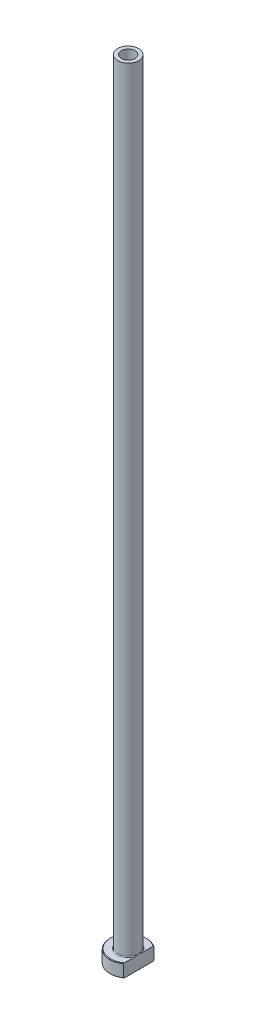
ISO-10303-21;
HEADER;
FILE_DESCRIPTION(('STEP AP214'),'2;1');
FILE_NAME('part.step','',(''),(''),'','','');
FILE_SCHEMA(('AUTOMOTIVE_DESIGN { 1 0 10303 214 1 1 1 1 }'));
ENDSEC;
DATA;
#1=APPLICATION_CONTEXT('core data for automotive mechanical design processes');
#2=APPLICATION_PROTOCOL_DEFINITION('international standard','automotive_design',2000,#1);
#3=PRODUCT_CONTEXT('',#1,'mechanical');
#4=PRODUCT('Part','Part','',(#3));
#5=PRODUCT_RELATED_PRODUCT_CATEGORY('part','',(#4));
#6=PRODUCT_DEFINITION_FORMATION('','',#4);
#7=PRODUCT_DEFINITION_CONTEXT('part definition',#1,'design');
#8=PRODUCT_DEFINITION('design','',#6,#7);
#9=PRODUCT_DEFINITION_SHAPE('','',#8);
#10=(LENGTH_UNIT() NAMED_UNIT(*) SI_UNIT(.MILLI.,.METRE.));
#11=(NAMED_UNIT(*) PLANE_ANGLE_UNIT() SI_UNIT($,.RADIAN.));
#12=(NAMED_UNIT(*) SI_UNIT($,.STERADIAN.) SOLID_ANGLE_UNIT());
#13=UNCERTAINTY_MEASURE_WITH_UNIT(LENGTH_MEASURE(1.E-05),#10,'distance_accuracy_value','');
#14=(GEOMETRIC_REPRESENTATION_CONTEXT(3) GLOBAL_UNCERTAINTY_ASSIGNED_CONTEXT((#13)) GLOBAL_UNIT_ASSIGNED_CONTEXT((#10,
#11,#12)) REPRESENTATION_CONTEXT('',''));
#15=CARTESIAN_POINT('',(0.,0.,0.));
#16=DIRECTION('',(0.,0.,1.));
#17=DIRECTION('',(1.,0.,0.));
#18=AXIS2_PLACEMENT_3D('',#15,#16,#17);
#19=CARTESIAN_POINT('',(0.,92.1876809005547,0.));
#20=DIRECTION('',(0.,1.,0.));
#21=DIRECTION('',(0.,0.,1.));
#22=AXIS2_PLACEMENT_3D('',#19,#20,#21);
#23=CYLINDRICAL_SURFACE('',#22,2.60000000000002);
#24=CARTESIAN_POINT('',(0.,300.,0.));
#25=DIRECTION('',(0.,1.,0.));
#26=DIRECTION('',(0.,0.,1.));
#27=AXIS2_PLACEMENT_3D('',#24,#25,#26);
#28=CIRCLE('',#27,2.60000000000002);
#29=CARTESIAN_POINT('',(0.,300.,2.60000000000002));
#30=VERTEX_POINT('',#29);
#31=EDGE_CURVE('E167',#30,#30,#28,.T.);
#32=ORIENTED_EDGE('',*,*,#31,.T.);
#33=EDGE_LOOP('',(#32));
#34=FACE_BOUND('',#33,.T.);
#35=CARTESIAN_POINT('',(0.,255.,0.));
#36=DIRECTION('',(0.,1.,0.));
#37=DIRECTION('',(0.,0.,1.));
#38=AXIS2_PLACEMENT_3D('',#35,#36,#37);
#39=CIRCLE('',#38,2.60000000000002);
#40=CARTESIAN_POINT('',(0.,255.,2.60000000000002));
#41=VERTEX_POINT('',#40);
#42=EDGE_CURVE('E170',#41,#41,#39,.T.);
#43=ORIENTED_EDGE('',*,*,#42,.F.);
#44=EDGE_LOOP('',(#43));
#45=FACE_BOUND('',#44,.T.);
#46=ADVANCED_FACE('F32',(#34,#45),#23,.F.);
#47=CARTESIAN_POINT('',(-2.60000000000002,300.,0.));
#48=DIRECTION('',(0.,1.,0.));
#49=DIRECTION('',(0.,0.,1.));
#50=AXIS2_PLACEMENT_3D('',#47,#48,#49);
#51=PLANE('',#50);
#52=CARTESIAN_POINT('',(0.,300.,0.));
#53=DIRECTION('',(0.,1.,0.));
#54=DIRECTION('',(0.,0.,1.));
#55=AXIS2_PLACEMENT_3D('',#52,#53,#54);
#56=CIRCLE('',#55,4.00000000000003);
#57=CARTESIAN_POINT('',(0.,300.,4.00000000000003));
#58=VERTEX_POINT('',#57);
#59=EDGE_CURVE('E174',#58,#58,#56,.T.);
#60=ORIENTED_EDGE('',*,*,#59,.T.);
#61=EDGE_LOOP('',(#60));
#62=FACE_BOUND('',#61,.T.);
#63=ORIENTED_EDGE('',*,*,#31,.F.);
#64=EDGE_LOOP('',(#63));
#65=FACE_BOUND('',#64,.T.);
#66=ADVANCED_FACE('F157',(#62,#65),#51,.T.);
#67=CARTESIAN_POINT('',(0.,92.1876809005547,0.));
#68=DIRECTION('',(0.,1.,0.));
#69=DIRECTION('',(0.,0.,1.));
#70=AXIS2_PLACEMENT_3D('',#67,#68,#69);
#71=CYLINDRICAL_SURFACE('',#70,4.00000000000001);
#72=CARTESIAN_POINT('',(0.,5.3,0.));
#73=DIRECTION('',(0.,1.,0.));
#74=DIRECTION('',(0.,0.,1.));
#75=AXIS2_PLACEMENT_3D('',#72,#73,#74);
#76=CIRCLE('',#75,4.00000000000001);
#77=CARTESIAN_POINT('',(4.,5.3,0.));
#78=VERTEX_POINT('',#77);
#79=EDGE_CURVE('E180',#78,#78,#76,.T.);
#80=ORIENTED_EDGE('',*,*,#79,.T.);
#81=EDGE_LOOP('',(#80));
#82=FACE_BOUND('',#81,.T.);
#83=ORIENTED_EDGE('',*,*,#59,.F.);
#84=EDGE_LOOP('',(#83));
#85=FACE_BOUND('',#84,.T.);
#86=ADVANCED_FACE('F162',(#82,#85),#71,.T.);
#87=CARTESIAN_POINT('',(-3.99999999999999,5.,0.));
#88=DIRECTION('',(0.,1.,0.));
#89=DIRECTION('',(0.,0.,1.));
#90=AXIS2_PLACEMENT_3D('',#87,#88,#89);
#91=PLANE('',#90);
#92=DIRECTION('',(0.,0.,1.));
#93=VECTOR('',#92,1.);
#94=CARTESIAN_POINT('',(4.,5.,0.));
#95=LINE('',#94,#93);
#96=CARTESIAN_POINT('',(4.,5.,-5.49909083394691));
#97=VERTEX_POINT('',#96);
#98=CARTESIAN_POINT('',(4.,5.,-1.57797338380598));
#99=VERTEX_POINT('',#98);
#100=EDGE_CURVE('E54',#97,#99,#95,.T.);
#101=ORIENTED_EDGE('',*,*,#100,.F.);
#102=CARTESIAN_POINT('',(0.,5.,0.));
#103=DIRECTION('',(0.,1.,0.));
#104=DIRECTION('',(0.,0.,1.));
#105=AXIS2_PLACEMENT_3D('',#102,#103,#104);
#106=CIRCLE('',#105,6.79999999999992);
#107=CARTESIAN_POINT('',(3.99999999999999,5.,5.49909083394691));
#108=VERTEX_POINT('',#107);
#109=EDGE_CURVE('E186',#97,#108,#106,.T.);
#110=ORIENTED_EDGE('',*,*,#109,.T.);
#111=CARTESIAN_POINT('',(4.,5.,1.57797338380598));
#112=VERTEX_POINT('',#111);
#113=EDGE_CURVE('E134',#112,#108,#95,.T.);
#114=ORIENTED_EDGE('',*,*,#113,.F.);
#115=CARTESIAN_POINT('',(0.,5.,0.));
#116=DIRECTION('',(0.,1.,0.));
#117=DIRECTION('',(0.,0.,1.));
#118=AXIS2_PLACEMENT_3D('',#115,#116,#117);
#119=CIRCLE('',#118,4.30000000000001);
#120=EDGE_CURVE('E183',#112,#99,#119,.F.);
#121=ORIENTED_EDGE('',*,*,#120,.T.);
#122=EDGE_LOOP('',(#101,#110,#114,#121));
#123=FACE_BOUND('',#122,.T.);
#124=ADVANCED_FACE('F197',(#123),#91,.T.);
#125=CARTESIAN_POINT('',(0.,92.1876809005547,0.));
#126=DIRECTION('',(0.,1.,0.));
#127=DIRECTION('',(0.,0.,1.));
#128=AXIS2_PLACEMENT_3D('',#125,#126,#127);
#129=CYLINDRICAL_SURFACE('',#128,6.99999999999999);
#130=DIRECTION('',(0.,-1.,0.));
#131=VECTOR('',#130,1.);
#132=CARTESIAN_POINT('',(3.99999999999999,300.,5.74456264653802));
#133=LINE('',#132,#131);
#134=CARTESIAN_POINT('',(3.99999999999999,4.79999999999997,5.74456264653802));
#135=VERTEX_POINT('',#134);
#136=CARTESIAN_POINT('',(3.99999999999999,0.20000000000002,5.74456264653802));
#137=VERTEX_POINT('',#136);
#138=EDGE_CURVE('E82',#135,#137,#133,.T.);
#139=ORIENTED_EDGE('',*,*,#138,.F.);
#140=CARTESIAN_POINT('',(0.,4.79999999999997,0.));
#141=DIRECTION('',(0.,1.,0.));
#142=DIRECTION('',(0.,0.,1.));
#143=AXIS2_PLACEMENT_3D('',#140,#141,#142);
#144=CIRCLE('',#143,6.99999999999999);
#145=CARTESIAN_POINT('',(4.,4.79999999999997,-5.74456264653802));
#146=VERTEX_POINT('',#145);
#147=EDGE_CURVE('E95',#135,#146,#144,.F.);
#148=ORIENTED_EDGE('',*,*,#147,.T.);
#149=DIRECTION('',(0.,-1.,0.));
#150=VECTOR('',#149,1.);
#151=CARTESIAN_POINT('',(4.,300.,-5.74456264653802));
#152=LINE('',#151,#150);
#153=CARTESIAN_POINT('',(4.,0.20000000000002,-5.74456264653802));
#154=VERTEX_POINT('',#153);
#155=EDGE_CURVE('E192',#146,#154,#152,.T.);
#156=ORIENTED_EDGE('',*,*,#155,.T.);
#157=CARTESIAN_POINT('',(0.,0.20000000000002,0.));
#158=DIRECTION('',(0.,-1.,0.));
#159=DIRECTION('',(0.,0.,-1.));
#160=AXIS2_PLACEMENT_3D('',#157,#158,#159);
#161=CIRCLE('',#160,6.99999999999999);
#162=EDGE_CURVE('E98',#154,#137,#161,.F.);
#163=ORIENTED_EDGE('',*,*,#162,.T.);
#164=EDGE_LOOP('',(#139,#148,#156,#163));
#165=FACE_BOUND('',#164,.T.);
#166=ADVANCED_FACE('F190',(#165),#129,.T.);
#167=CARTESIAN_POINT('',(-6.99999999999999,0.,0.));
#168=DIRECTION('',(0.,-1.,0.));
#169=DIRECTION('',(0.,0.,-1.));
#170=AXIS2_PLACEMENT_3D('',#167,#168,#169);
#171=PLANE('',#170);
#172=CARTESIAN_POINT('',(0.,0.,0.));
#173=DIRECTION('',(0.,-1.,0.));
#174=DIRECTION('',(0.,0.,-1.));
#175=AXIS2_PLACEMENT_3D('',#172,#173,#174);
#176=CIRCLE('',#175,3.34999999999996);
#177=CARTESIAN_POINT('',(0.,0.,-3.34999999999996));
#178=VERTEX_POINT('',#177);
#179=EDGE_CURVE('E40',#178,#178,#176,.F.);
#180=ORIENTED_EDGE('',*,*,#179,.T.);
#181=EDGE_LOOP('',(#180));
#182=FACE_BOUND('',#181,.T.);
#183=DIRECTION('',(0.,0.,-1.));
#184=VECTOR('',#183,1.);
#185=CARTESIAN_POINT('',(3.99999999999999,0.,5.74456264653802));
#186=LINE('',#185,#184);
#187=CARTESIAN_POINT('',(3.99999999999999,0.,5.49909083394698));
#188=VERTEX_POINT('',#187);
#189=CARTESIAN_POINT('',(4.,0.,-5.49909083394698));
#190=VERTEX_POINT('',#189);
#191=EDGE_CURVE('E47',#188,#190,#186,.T.);
#192=ORIENTED_EDGE('',*,*,#191,.F.);
#193=CARTESIAN_POINT('',(0.,0.,0.));
#194=DIRECTION('',(0.,-1.,0.));
#195=DIRECTION('',(0.,0.,-1.));
#196=AXIS2_PLACEMENT_3D('',#193,#194,#195);
#197=CIRCLE('',#196,6.79999999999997);
#198=EDGE_CURVE('E92',#188,#190,#197,.T.);
#199=ORIENTED_EDGE('',*,*,#198,.T.);
#200=EDGE_LOOP('',(#192,#199));
#201=FACE_BOUND('',#200,.T.);
#202=ADVANCED_FACE('F91',(#182,#201),#171,.T.);
#203=CARTESIAN_POINT('',(0.,92.1876809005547,0.));
#204=DIRECTION('',(0.,1.,0.));
#205=DIRECTION('',(0.,0.,1.));
#206=AXIS2_PLACEMENT_3D('',#203,#204,#205);
#207=CYLINDRICAL_SURFACE('',#206,2.85000000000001);
#208=CARTESIAN_POINT('',(0.,0.499999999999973,0.));
#209=DIRECTION('',(0.,-1.,0.));
#210=DIRECTION('',(0.,0.,-1.));
#211=AXIS2_PLACEMENT_3D('',#208,#209,#210);
#212=CIRCLE('',#211,2.85000000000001);
#213=CARTESIAN_POINT('',(0.,0.499999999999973,-2.85000000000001));
#214=VERTEX_POINT('',#213);
#215=EDGE_CURVE('E11',#214,#214,#212,.T.);
#216=ORIENTED_EDGE('',*,*,#215,.T.);
#217=EDGE_LOOP('',(#216));
#218=FACE_BOUND('',#217,.T.);
#219=CARTESIAN_POINT('',(0.,243.,0.));
#220=DIRECTION('',(0.,1.,0.));
#221=DIRECTION('',(0.,0.,1.));
#222=AXIS2_PLACEMENT_3D('',#219,#220,#221);
#223=CIRCLE('',#222,2.85000000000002);
#224=CARTESIAN_POINT('',(0.,243.,2.85000000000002));
#225=VERTEX_POINT('',#224);
#226=EDGE_CURVE('E172',#225,#225,#223,.T.);
#227=ORIENTED_EDGE('',*,*,#226,.T.);
#228=EDGE_LOOP('',(#227));
#229=FACE_BOUND('',#228,.T.);
#230=ADVANCED_FACE('F215',(#218,#229),#207,.F.);
#231=CARTESIAN_POINT('',(0.,243.,0.));
#232=DIRECTION('',(0.,-1.,0.));
#233=DIRECTION('',(0.,0.,-1.));
#234=AXIS2_PLACEMENT_3D('',#231,#232,#233);
#235=CONICAL_SURFACE('',#234,2.85000000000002,0.0208303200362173);
#236=ORIENTED_EDGE('',*,*,#42,.T.);
#237=EDGE_LOOP('',(#236));
#238=FACE_BOUND('',#237,.T.);
#239=ORIENTED_EDGE('',*,*,#226,.F.);
#240=EDGE_LOOP('',(#239));
#241=FACE_BOUND('',#240,.T.);
#242=ADVANCED_FACE('F111',(#238,#241),#235,.F.);
#243=CARTESIAN_POINT('',(0.,5.3,0.));
#244=DIRECTION('',(0.,1.,0.));
#245=DIRECTION('',(0.,0.,1.));
#246=AXIS2_PLACEMENT_3D('',#243,#244,#245);
#247=TOROIDAL_SURFACE('',#246,4.30000000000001,0.3);
#248=ORIENTED_EDGE('',*,*,#120,.F.);
#249=CARTESIAN_POINT('',(4.,5.3,0.));
#250=CARTESIAN_POINT('',(4.,5.30000062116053,-1.06261146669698E-10));
#251=CARTESIAN_POINT('',(4.,5.30000124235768,2.17726199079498E-07));
#252=CARTESIAN_POINT('',(4.,5.30000240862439,8.36141292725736E-07));
#253=CARTESIAN_POINT('',(4.,5.30000294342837,1.25011714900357E-06));
#254=CARTESIAN_POINT('',(4.,5.30000404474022,2.23959386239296E-06));
#255=CARTESIAN_POINT('',(4.,5.30000459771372,2.83084521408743E-06));
#256=CARTESIAN_POINT('',(4.,5.30000559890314,4.06516670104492E-06));
#257=CARTESIAN_POINT('',(4.,5.30000604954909,4.70640147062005E-06));
#258=CARTESIAN_POINT('',(4.,5.30000769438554,7.15677314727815E-06));
#259=CARTESIAN_POINT('',(4.,5.30000879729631,9.02996112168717E-06));
#260=CARTESIAN_POINT('',(4.,5.30001063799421,1.27664902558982E-05));
#261=CARTESIAN_POINT('',(4.,5.30001139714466,1.46197820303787E-05));
#262=CARTESIAN_POINT('',(4.,5.30001453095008,2.23679246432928E-05));
#263=CARTESIAN_POINT('',(4.,5.3000168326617,2.82968783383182E-05));
#264=CARTESIAN_POINT('',(4.,5.30002027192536,3.95668769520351E-05));
#265=CARTESIAN_POINT('',(4.,5.30002152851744,4.48715497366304E-05));
#266=CARTESIAN_POINT('',(4.,5.30003060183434,8.40118257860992E-05));
#267=CARTESIAN_POINT('',(4.,5.3000373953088,0.000118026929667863));
#268=CARTESIAN_POINT('',(4.,5.30006713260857,0.000252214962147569));
#269=CARTESIAN_POINT('',(4.,5.30009559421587,0.000351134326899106));
#270=CARTESIAN_POINT('',(4.,5.30020622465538,0.000742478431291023));
#271=CARTESIAN_POINT('',(4.,5.30028475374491,0.00103561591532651));
#272=CARTESIAN_POINT('',(4.,5.30059889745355,0.00219920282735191));
#273=CARTESIAN_POINT('',(4.,5.30083905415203,0.00306873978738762));
#274=CARTESIAN_POINT('',(4.,5.30183682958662,0.0066914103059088));
#275=CARTESIAN_POINT('',(4.,5.30258877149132,0.00944568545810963));
#276=CARTESIAN_POINT('',(3.99999999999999,5.31066890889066,0.0390293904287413));
#277=CARTESIAN_POINT('',(4.,5.31802631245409,0.0658531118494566));
#278=CARTESIAN_POINT('',(4.,5.33239676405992,0.118441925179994));
#279=CARTESIAN_POINT('',(4.,5.33941183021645,0.144206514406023));
#280=CARTESIAN_POINT('',(4.,5.35427366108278,0.199017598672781));
#281=CARTESIAN_POINT('',(4.,5.36211313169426,0.228066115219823));
#282=CARTESIAN_POINT('',(4.,5.37776349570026,0.28651184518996));
#283=CARTESIAN_POINT('',(4.,5.38557313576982,0.315909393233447));
#284=CARTESIAN_POINT('',(4.,5.404256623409,0.386994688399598));
#285=CARTESIAN_POINT('',(4.,5.41505237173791,0.428703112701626));
#286=CARTESIAN_POINT('',(4.,5.4359231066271,0.511098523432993));
#287=CARTESIAN_POINT('',(4.,5.44600969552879,0.551782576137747));
#288=CARTESIAN_POINT('',(4.,5.47850986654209,0.686599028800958));
#289=CARTESIAN_POINT('',(4.,5.49978370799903,0.781011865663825));
#290=CARTESIAN_POINT('',(4.,5.53807543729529,0.971847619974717));
#291=CARTESIAN_POINT('',(4.,5.55504273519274,1.06828120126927));
#292=CARTESIAN_POINT('',(4.,5.57582405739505,1.21752725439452));
#293=CARTESIAN_POINT('',(4.,5.58209796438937,1.26999379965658));
#294=CARTESIAN_POINT('',(4.,5.59210686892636,1.37516324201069));
#295=CARTESIAN_POINT('',(4.,5.59584265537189,1.42786606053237));
#296=CARTESIAN_POINT('',(4.,5.60010438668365,1.53310673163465));
#297=CARTESIAN_POINT('',(4.,5.6006487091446,1.58564378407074));
#298=CARTESIAN_POINT('',(4.,5.59767158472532,1.69058605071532));
#299=CARTESIAN_POINT('',(4.,5.59415502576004,1.74299134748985));
#300=CARTESIAN_POINT('',(4.,5.58503062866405,1.81903290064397));
#301=CARTESIAN_POINT('',(4.,5.58157617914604,1.84292934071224));
#302=CARTESIAN_POINT('',(4.,5.57329952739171,1.89051061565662));
#303=CARTESIAN_POINT('',(4.,5.56847619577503,1.91419525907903));
#304=CARTESIAN_POINT('',(4.,5.55726644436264,1.96092888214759));
#305=CARTESIAN_POINT('',(4.,5.55089740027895,1.9839819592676));
#306=CARTESIAN_POINT('',(4.,5.53623434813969,2.02945550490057));
#307=CARTESIAN_POINT('',(4.,5.52794253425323,2.0518766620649));
#308=CARTESIAN_POINT('',(4.,5.50887098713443,2.09590631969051));
#309=CARTESIAN_POINT('',(4.,5.49806837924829,2.11750508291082));
#310=CARTESIAN_POINT('',(4.,5.47333401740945,2.15885583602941));
#311=CARTESIAN_POINT('',(4.,5.45941272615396,2.1786136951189));
#312=CARTESIAN_POINT('',(4.,5.4358822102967,2.20522942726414));
#313=CARTESIAN_POINT('',(4.,5.42781139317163,2.2134404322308));
#314=CARTESIAN_POINT('',(4.,5.41065114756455,2.228751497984));
#315=CARTESIAN_POINT('',(4.,5.40156129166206,2.23585108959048));
#316=CARTESIAN_POINT('',(4.,5.38220524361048,2.24859694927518));
#317=CARTESIAN_POINT('',(4.,5.37192420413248,2.25422119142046));
#318=CARTESIAN_POINT('',(4.,5.35045072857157,2.26331064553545));
#319=CARTESIAN_POINT('',(4.,5.33926122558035,2.26678251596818));
#320=CARTESIAN_POINT('',(4.,5.31952044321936,2.27051268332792));
#321=CARTESIAN_POINT('',(4.,5.31108453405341,2.27139016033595));
#322=CARTESIAN_POINT('',(4.,5.29418624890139,2.27168963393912));
#323=CARTESIAN_POINT('',(4.,5.28572387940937,2.27111196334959));
#324=CARTESIAN_POINT('',(4.,5.26904138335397,2.26855580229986));
#325=CARTESIAN_POINT('',(4.,5.26082066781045,2.26658107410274));
#326=CARTESIAN_POINT('',(4.,5.24478214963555,2.26139496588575));
#327=CARTESIAN_POINT('',(4.,5.23696461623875,2.25818277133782));
#328=CARTESIAN_POINT('',(4.,5.21851235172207,2.24908332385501));
#329=CARTESIAN_POINT('',(4.,5.2081521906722,2.24264095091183));
#330=CARTESIAN_POINT('',(4.,5.18857975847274,2.22819957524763));
#331=CARTESIAN_POINT('',(4.,5.17937061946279,2.22019647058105));
#332=CARTESIAN_POINT('',(4.,5.15665383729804,2.19777756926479));
#333=CARTESIAN_POINT('',(4.,5.14403484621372,2.18246908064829));
#334=CARTESIAN_POINT('',(4.,5.12118369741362,2.15020843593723));
#335=CARTESIAN_POINT('',(4.,5.11095480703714,2.13325407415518));
#336=CARTESIAN_POINT('',(4.,5.09273574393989,2.09892324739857));
#337=CARTESIAN_POINT('',(4.,5.08468212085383,2.08157988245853));
#338=CARTESIAN_POINT('',(4.,5.07005901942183,2.04627072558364));
#339=CARTESIAN_POINT('',(4.,5.06349101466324,2.02830433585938));
#340=CARTESIAN_POINT('',(4.,5.0455548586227,1.97350761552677));
#341=CARTESIAN_POINT('',(4.,5.03608974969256,1.93605770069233));
#342=CARTESIAN_POINT('',(4.,5.01780569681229,1.84529235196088));
#343=CARTESIAN_POINT('',(4.,5.01077018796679,1.79164082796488));
#344=CARTESIAN_POINT('',(4.,5.00182846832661,1.68379947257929));
#345=CARTESIAN_POINT('',(4.,4.99993887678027,1.62960846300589));
#346=CARTESIAN_POINT('',(4.,5.00006129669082,1.5236120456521));
#347=CARTESIAN_POINT('',(4.,5.00190698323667,1.47180551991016));
#348=CARTESIAN_POINT('',(4.,5.00841243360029,1.36835357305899));
#349=CARTESIAN_POINT('',(4.,5.01307376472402,1.316708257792));
#350=CARTESIAN_POINT('',(4.,5.0290548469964,1.17431887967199));
#351=CARTESIAN_POINT('',(4.,5.04274090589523,1.08384207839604));
#352=CARTESIAN_POINT('',(4.,5.0670171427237,0.947757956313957));
#353=CARTESIAN_POINT('',(4.,5.07585573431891,0.90181406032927));
#354=CARTESIAN_POINT('',(4.,5.09458665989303,0.810008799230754));
#355=CARTESIAN_POINT('',(4.,5.10448180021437,0.764148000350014));
#356=CARTESIAN_POINT('',(4.,5.1289243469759,0.655631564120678));
#357=CARTESIAN_POINT('',(4.,5.14383556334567,0.593058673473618));
#358=CARTESIAN_POINT('',(4.,5.17458762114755,0.468885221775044));
#359=CARTESIAN_POINT('',(4.,5.19041623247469,0.407281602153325));
#360=CARTESIAN_POINT('',(4.,5.22090834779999,0.291232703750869));
#361=CARTESIAN_POINT('',(4.,5.23550024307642,0.236768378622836));
#362=CARTESIAN_POINT('',(3.99999999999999,5.26562550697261,0.125604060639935));
#363=CARTESIAN_POINT('',(3.99999999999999,5.28117250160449,0.068907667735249));
#364=CARTESIAN_POINT('',(4.,5.29741226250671,0.00944154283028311));
#365=CARTESIAN_POINT('',(4.,5.29816540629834,0.00668315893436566));
#366=CARTESIAN_POINT('',(4.,5.29916346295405,0.00305954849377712));
#367=CARTESIAN_POINT('',(4.,5.29940273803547,0.00219318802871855));
#368=CARTESIAN_POINT('',(4.,5.29971580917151,0.00103357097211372));
#369=CARTESIAN_POINT('',(4.,5.29979412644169,0.000741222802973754));
#370=CARTESIAN_POINT('',(4.,5.29990450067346,0.000350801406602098));
#371=CARTESIAN_POINT('',(4.,5.29993292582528,0.000252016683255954));
#372=CARTESIAN_POINT('',(4.,5.29996263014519,0.000117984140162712));
#373=CARTESIAN_POINT('',(4.,5.299969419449,8.39881949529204E-05));
#374=CARTESIAN_POINT('',(4.,5.29997848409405,4.48674047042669E-05));
#375=CARTESIAN_POINT('',(4.,5.29997973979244,3.95638224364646E-05));
#376=CARTESIAN_POINT('',(4.,5.29998317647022,2.82960367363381E-05));
#377=CARTESIAN_POINT('',(4.,5.29998547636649,2.23681476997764E-05));
#378=CARTESIAN_POINT('',(4.,5.29998860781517,1.46211013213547E-05));
#379=CARTESIAN_POINT('',(4.,5.29998936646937,1.27678912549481E-05));
#380=CARTESIAN_POINT('',(4.,5.29999120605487,9.03144163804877E-06));
#381=CARTESIAN_POINT('',(4.,5.29999230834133,7.15824173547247E-06));
#382=CARTESIAN_POINT('',(4.,5.29999395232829,4.70775574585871E-06));
#383=CARTESIAN_POINT('',(4.,5.29999440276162,4.06646440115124E-06));
#384=CARTESIAN_POINT('',(4.,5.2999954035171,2.83199139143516E-06));
#385=CARTESIAN_POINT('',(4.,5.299995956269,2.24064386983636E-06));
#386=CARTESIAN_POINT('',(4.,5.29999705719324,1.25094003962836E-06));
#387=CARTESIAN_POINT('',(4.,5.29999759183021,8.36841346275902E-07));
#388=CARTESIAN_POINT('',(4.,5.29999875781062,2.18117879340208E-07));
#389=CARTESIAN_POINT('',(4.,5.299999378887,1.0625422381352E-10));
#390=CARTESIAN_POINT('',(4.,5.3,0.));
#391=B_SPLINE_CURVE_WITH_KNOTS('',3,(#249,#250,#251,#252,#253,#254,#255,#256,#257,#258,#259,
#260,#261,#262,#263,#264,#265,#266,#267,#268,#269,#270,#271,#272,#273,#274,#275,#276,#277,#278,
#279,#280,#281,#282,#283,#284,#285,#286,#287,#288,#289,#290,#291,#292,#293,#294,#295,#296,#297,
#298,#299,#300,#301,#302,#303,#304,#305,#306,#307,#308,#309,#310,#311,#312,#313,#314,#315,#316,
#317,#318,#319,#320,#321,#322,#323,#324,#325,#326,#327,#328,#329,#330,#331,#332,#333,#334,#335,
#336,#337,#338,#339,#340,#341,#342,#343,#344,#345,#346,#347,#348,#349,#350,#351,#352,#353,#354,
#355,#356,#357,#358,#359,#360,#361,#362,#363,#364,#365,#366,#367,#368,#369,#370,#371,#372,#373,
#374,#375,#376,#377,#378,#379,#380,#381,#382,#383,#384,#385,#386,#387,#388,#389,#390),
.UNSPECIFIED.,.T.,.F.,(4,2,2,2,2,2,2,2,2,2,2,2,2,2,2,2,2,2,2,2,2,2,2,2,2,2,2,2,2,2,2,2,2,2,2,2,
2,2,2,2,2,2,2,2,2,2,2,2,2,2,2,2,2,2,2,2,2,2,2,2,2,2,2,2,2,2,2,2,2,2,4),(0.,1.87484270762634E-06,
3.90179765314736E-06,6.31683512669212E-06,8.66651565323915E-06,1.51627509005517E-05,
2.11657875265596E-05,4.02090722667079E-05,5.65429401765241E-05,0.0001606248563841,
0.000469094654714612,0.00137985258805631,0.00408571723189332,0.0126514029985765,
0.0960918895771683,0.176200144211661,0.266463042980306,0.357714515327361,0.48696124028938,
0.612707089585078,0.902988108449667,1.19653589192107,1.35501075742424,1.51343634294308,
1.67094875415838,1.82827177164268,1.90067591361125,1.97313996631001,2.04482437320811,
2.11642737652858,2.18871023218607,2.26075412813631,2.29521947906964,2.32969934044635,
2.36466792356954,2.39952778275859,2.42485422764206,2.45017488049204,2.47542760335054,
2.50069697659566,2.53708899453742,2.57357798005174,2.63276032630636,2.69202310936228,
2.74930315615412,2.80663977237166,2.92223125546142,3.08420752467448,3.24670629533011,
3.40212850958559,3.55763731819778,3.83192962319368,3.97228382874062,4.11302057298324,
4.30598130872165,4.49678885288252,4.6659444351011,4.84230602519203,4.85088453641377,
4.85358051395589,4.85448881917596,4.8547968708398,4.8549008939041,4.8549172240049,
4.85493626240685,4.85494226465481,4.85494875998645,4.85495110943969,4.85495352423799,
4.85495555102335,4.8549574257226),.UNSPECIFIED.);
#392=EDGE_CURVE('E126',#112,#78,#391,.T.);
#393=ORIENTED_EDGE('',*,*,#392,.T.);
#394=ORIENTED_EDGE('',*,*,#79,.F.);
#395=CARTESIAN_POINT('',(4.,5.3,0.));
#396=CARTESIAN_POINT('',(4.,5.29999937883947,1.0626241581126E-10));
#397=CARTESIAN_POINT('',(4.,5.29999875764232,-2.17726197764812E-07));
#398=CARTESIAN_POINT('',(4.,5.2999975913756,-8.36141291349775E-07));
#399=CARTESIAN_POINT('',(4.,5.29999705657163,-1.2501171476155E-06));
#400=CARTESIAN_POINT('',(4.,5.29999595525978,-2.23959386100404E-06));
#401=CARTESIAN_POINT('',(4.,5.29999540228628,-2.83084521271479E-06));
#402=CARTESIAN_POINT('',(4.,5.29999440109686,-4.06516669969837E-06));
#403=CARTESIAN_POINT('',(4.,5.29999395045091,-4.7064014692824E-06));
#404=CARTESIAN_POINT('',(4.,5.29999230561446,-7.15677314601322E-06));
#405=CARTESIAN_POINT('',(4.,5.29999120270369,-9.02996112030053E-06));
#406=CARTESIAN_POINT('',(4.,5.29998936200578,-1.27664902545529E-05));
#407=CARTESIAN_POINT('',(4.,5.29998860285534,-1.46197820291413E-05));
#408=CARTESIAN_POINT('',(4.,5.29998546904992,-2.23679246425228E-05));
#409=CARTESIAN_POINT('',(4.,5.2999831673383,-2.8296878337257E-05));
#410=CARTESIAN_POINT('',(4.,5.29997972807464,-3.95668769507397E-05));
#411=CARTESIAN_POINT('',(4.,5.29997847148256,-4.48715497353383E-05));
#412=CARTESIAN_POINT('',(4.,5.29996939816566,-8.40118257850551E-05));
#413=CARTESIAN_POINT('',(4.,5.2999626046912,-0.000118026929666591));
#414=CARTESIAN_POINT('',(4.,5.29993286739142,-0.000252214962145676));
#415=CARTESIAN_POINT('',(4.,5.29990440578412,-0.000351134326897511));
#416=CARTESIAN_POINT('',(4.,5.29979377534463,-0.000742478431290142));
#417=CARTESIAN_POINT('',(4.,5.29971524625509,-0.00103561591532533));
#418=CARTESIAN_POINT('',(4.,5.29940110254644,-0.00219920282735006));
#419=CARTESIAN_POINT('',(4.,5.29916094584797,-0.00306873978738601));
#420=CARTESIAN_POINT('',(4.,5.29816317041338,-0.00669141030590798));
#421=CARTESIAN_POINT('',(4.,5.29741122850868,-0.00944568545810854));
#422=CARTESIAN_POINT('',(3.99999999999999,5.28933109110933,-0.0390293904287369));
#423=CARTESIAN_POINT('',(4.,5.2819736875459,-0.065853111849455));
#424=CARTESIAN_POINT('',(4.,5.26760323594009,-0.118441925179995));
#425=CARTESIAN_POINT('',(4.,5.26058816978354,-0.144206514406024));
#426=CARTESIAN_POINT('',(4.,5.24572633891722,-0.199017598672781));
#427=CARTESIAN_POINT('',(4.,5.23788686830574,-0.228066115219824));
#428=CARTESIAN_POINT('',(4.,5.22223650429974,-0.28651184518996));
#429=CARTESIAN_POINT('',(4.,5.21442686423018,-0.315909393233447));
#430=CARTESIAN_POINT('',(4.,5.195743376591,-0.386994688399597));
#431=CARTESIAN_POINT('',(4.,5.18494762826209,-0.428703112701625));
#432=CARTESIAN_POINT('',(4.,5.1640768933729,-0.511098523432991));
#433=CARTESIAN_POINT('',(4.,5.1539903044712,-0.551782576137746));
#434=CARTESIAN_POINT('',(4.,5.12149013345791,-0.686599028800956));
#435=CARTESIAN_POINT('',(4.,5.10021629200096,-0.781011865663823));
#436=CARTESIAN_POINT('',(4.,5.06192456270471,-0.971847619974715));
#437=CARTESIAN_POINT('',(4.,5.04495726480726,-1.06828120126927));
#438=CARTESIAN_POINT('',(4.,5.02417594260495,-1.21752725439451));
#439=CARTESIAN_POINT('',(4.,5.01790203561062,-1.26999379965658));
#440=CARTESIAN_POINT('',(4.,5.00789313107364,-1.37516324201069));
#441=CARTESIAN_POINT('',(4.,5.00415734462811,-1.42786606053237));
#442=CARTESIAN_POINT('',(4.,4.99989561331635,-1.53310673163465));
#443=CARTESIAN_POINT('',(4.,4.9993512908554,-1.58564378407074));
#444=CARTESIAN_POINT('',(4.,5.00232841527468,-1.69058605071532));
#445=CARTESIAN_POINT('',(4.,5.00584497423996,-1.74299134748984));
#446=CARTESIAN_POINT('',(4.,5.01496937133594,-1.81903290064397));
#447=CARTESIAN_POINT('',(4.,5.01842382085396,-1.84292934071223));
#448=CARTESIAN_POINT('',(4.,5.02670047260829,-1.89051061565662));
#449=CARTESIAN_POINT('',(4.,5.03152380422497,-1.91419525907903));
#450=CARTESIAN_POINT('',(4.,5.04273355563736,-1.96092888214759));
#451=CARTESIAN_POINT('',(4.,5.04910259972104,-1.9839819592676));
#452=CARTESIAN_POINT('',(4.,5.06376565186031,-2.02945550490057));
#453=CARTESIAN_POINT('',(4.,5.07205746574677,-2.0518766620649));
#454=CARTESIAN_POINT('',(4.,5.09112901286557,-2.0959063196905));
#455=CARTESIAN_POINT('',(4.,5.10193162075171,-2.11750508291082));
#456=CARTESIAN_POINT('',(4.,5.12666598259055,-2.15885583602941));
#457=CARTESIAN_POINT('',(4.,5.14058727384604,-2.17861369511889));
#458=CARTESIAN_POINT('',(4.,5.1641177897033,-2.20522942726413));
#459=CARTESIAN_POINT('',(4.,5.17218860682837,-2.2134404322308));
#460=CARTESIAN_POINT('',(4.,5.18934885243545,-2.22875149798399));
#461=CARTESIAN_POINT('',(4.,5.19843870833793,-2.23585108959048));
#462=CARTESIAN_POINT('',(4.,5.21779475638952,-2.24859694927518));
#463=CARTESIAN_POINT('',(4.,5.22807579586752,-2.25422119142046));
#464=CARTESIAN_POINT('',(4.,5.24954927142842,-2.26331064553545));
#465=CARTESIAN_POINT('',(4.,5.26073877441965,-2.26678251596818));
#466=CARTESIAN_POINT('',(4.,5.28047955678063,-2.27051268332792));
#467=CARTESIAN_POINT('',(4.,5.28891546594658,-2.27139016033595));
#468=CARTESIAN_POINT('',(4.,5.3058137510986,-2.27168963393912));
#469=CARTESIAN_POINT('',(4.,5.31427612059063,-2.27111196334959));
#470=CARTESIAN_POINT('',(4.,5.33095861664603,-2.26855580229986));
#471=CARTESIAN_POINT('',(4.,5.33917933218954,-2.26658107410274));
#472=CARTESIAN_POINT('',(4.,5.35521785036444,-2.26139496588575));
#473=CARTESIAN_POINT('',(4.,5.36303538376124,-2.25818277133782));
#474=CARTESIAN_POINT('',(4.,5.38148764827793,-2.24908332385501));
#475=CARTESIAN_POINT('',(4.,5.3918478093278,-2.24264095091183));
#476=CARTESIAN_POINT('',(4.,5.41142024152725,-2.22819957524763));
#477=CARTESIAN_POINT('',(4.,5.4206293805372,-2.22019647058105));
#478=CARTESIAN_POINT('',(4.,5.44334616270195,-2.19777756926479));
#479=CARTESIAN_POINT('',(4.,5.45596515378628,-2.18246908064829));
#480=CARTESIAN_POINT('',(4.,5.47881630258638,-2.15020843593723));
#481=CARTESIAN_POINT('',(4.,5.48904519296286,-2.13325407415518));
#482=CARTESIAN_POINT('',(4.,5.50726425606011,-2.09892324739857));
#483=CARTESIAN_POINT('',(4.,5.51531787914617,-2.08157988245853));
#484=CARTESIAN_POINT('',(4.,5.52994098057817,-2.04627072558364));
#485=CARTESIAN_POINT('',(4.,5.53650898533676,-2.02830433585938));
#486=CARTESIAN_POINT('',(4.,5.5544451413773,-1.97350761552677));
#487=CARTESIAN_POINT('',(4.,5.56391025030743,-1.93605770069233));
#488=CARTESIAN_POINT('',(4.,5.5821943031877,-1.84529235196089));
#489=CARTESIAN_POINT('',(4.,5.58922981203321,-1.79164082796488));
#490=CARTESIAN_POINT('',(4.,5.59817153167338,-1.68379947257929));
#491=CARTESIAN_POINT('',(4.,5.60006112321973,-1.62960846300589));
#492=CARTESIAN_POINT('',(4.,5.59993870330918,-1.5236120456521));
#493=CARTESIAN_POINT('',(4.,5.59809301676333,-1.47180551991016));
#494=CARTESIAN_POINT('',(4.,5.59158756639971,-1.36835357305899));
#495=CARTESIAN_POINT('',(4.,5.58692623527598,-1.316708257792));
#496=CARTESIAN_POINT('',(4.,5.5709451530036,-1.17431887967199));
#497=CARTESIAN_POINT('',(4.,5.55725909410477,-1.08384207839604));
#498=CARTESIAN_POINT('',(4.,5.53298285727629,-0.947757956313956));
#499=CARTESIAN_POINT('',(4.,5.52414426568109,-0.901814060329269));
#500=CARTESIAN_POINT('',(4.,5.50541334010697,-0.810008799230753));
#501=CARTESIAN_POINT('',(4.,5.49551819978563,-0.764148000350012));
#502=CARTESIAN_POINT('',(4.,5.4710756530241,-0.655631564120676));
#503=CARTESIAN_POINT('',(4.,5.45616443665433,-0.593058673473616));
#504=CARTESIAN_POINT('',(4.,5.42541237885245,-0.468885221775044));
#505=CARTESIAN_POINT('',(4.,5.4095837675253,-0.407281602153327));
#506=CARTESIAN_POINT('',(4.,5.37909165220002,-0.291232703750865));
#507=CARTESIAN_POINT('',(4.,5.36449975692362,-0.236768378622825));
#508=CARTESIAN_POINT('',(3.99999999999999,5.33437449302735,-0.125604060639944));
#509=CARTESIAN_POINT('',(3.99999999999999,5.31882749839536,-0.0689076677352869));
#510=CARTESIAN_POINT('',(4.,5.30258773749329,-0.00944154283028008));
#511=CARTESIAN_POINT('',(4.,5.30183459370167,-0.00668315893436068));
#512=CARTESIAN_POINT('',(4.,5.30083653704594,-0.00305954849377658));
#513=CARTESIAN_POINT('',(4.,5.30059726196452,-0.00219318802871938));
#514=CARTESIAN_POINT('',(4.,5.30028419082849,-0.00103357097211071));
#515=CARTESIAN_POINT('',(4.,5.30020587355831,-0.000741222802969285));
#516=CARTESIAN_POINT('',(4.,5.30009549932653,-0.000350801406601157));
#517=CARTESIAN_POINT('',(4.,5.30006707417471,-0.000252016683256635));
#518=CARTESIAN_POINT('',(4.,5.30003736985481,-0.000117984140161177));
#519=CARTESIAN_POINT('',(4.,5.30003058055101,-8.39881949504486E-05));
#520=CARTESIAN_POINT('',(4.,5.30002151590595,-4.48674047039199E-05));
#521=CARTESIAN_POINT('',(4.,5.30002026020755,-3.95638224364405E-05));
#522=CARTESIAN_POINT('',(4.,5.30001682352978,-2.8296036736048E-05));
#523=CARTESIAN_POINT('',(4.,5.30001452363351,-2.23681476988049E-05));
#524=CARTESIAN_POINT('',(4.,5.30001139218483,-1.46211013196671E-05));
#525=CARTESIAN_POINT('',(4.,5.30001063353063,-1.27678912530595E-05));
#526=CARTESIAN_POINT('',(4.,5.30000879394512,-9.03144163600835E-06));
#527=CARTESIAN_POINT('',(4.,5.30000769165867,-7.15824173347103E-06));
#528=CARTESIAN_POINT('',(4.,5.30000604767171,-4.70775574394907E-06));
#529=CARTESIAN_POINT('',(4.,5.30000559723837,-4.06646439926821E-06));
#530=CARTESIAN_POINT('',(4.,5.3000045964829,-2.83199138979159E-06));
#531=CARTESIAN_POINT('',(4.,5.300004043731,-2.2406438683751E-06));
#532=CARTESIAN_POINT('',(4.,5.30000294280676,-1.25094003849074E-06));
#533=CARTESIAN_POINT('',(4.,5.30000240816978,-8.36841345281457E-07));
#534=CARTESIAN_POINT('',(4.,5.30000124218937,-2.18117878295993E-07));
#535=CARTESIAN_POINT('',(4.,5.300000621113,-1.06253077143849E-10));
#536=CARTESIAN_POINT('',(4.,5.3,0.));
#537=B_SPLINE_CURVE_WITH_KNOTS('',3,(#395,#396,#397,#398,#399,#400,#401,#402,#403,#404,#405,
#406,#407,#408,#409,#410,#411,#412,#413,#414,#415,#416,#417,#418,#419,#420,#421,#422,#423,#424,
#425,#426,#427,#428,#429,#430,#431,#432,#433,#434,#435,#436,#437,#438,#439,#440,#441,#442,#443,
#444,#445,#446,#447,#448,#449,#450,#451,#452,#453,#454,#455,#456,#457,#458,#459,#460,#461,#462,
#463,#464,#465,#466,#467,#468,#469,#470,#471,#472,#473,#474,#475,#476,#477,#478,#479,#480,#481,
#482,#483,#484,#485,#486,#487,#488,#489,#490,#491,#492,#493,#494,#495,#496,#497,#498,#499,#500,
#501,#502,#503,#504,#505,#506,#507,#508,#509,#510,#511,#512,#513,#514,#515,#516,#517,#518,#519,
#520,#521,#522,#523,#524,#525,#526,#527,#528,#529,#530,#531,#532,#533,#534,#535,#536),
.UNSPECIFIED.,.T.,.F.,(4,2,2,2,2,2,2,2,2,2,2,2,2,2,2,2,2,2,2,2,2,2,2,2,2,2,2,2,2,2,2,2,2,2,2,2,
2,2,2,2,2,2,2,2,2,2,2,2,2,2,2,2,2,2,2,2,2,2,2,2,2,2,2,2,2,2,2,2,2,2,4),(0.,1.87484270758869E-06,
3.90179765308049E-06,6.31683512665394E-06,8.66651565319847E-06,1.51627509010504E-05,
2.11657875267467E-05,4.02090722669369E-05,5.65429401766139E-05,0.000160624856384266,
0.000469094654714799,0.00137985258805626,0.00408571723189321,0.0126514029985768,
0.0960918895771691,0.176200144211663,0.266463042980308,0.357714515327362,0.48696124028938,
0.612707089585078,0.902988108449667,1.19653589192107,1.35501075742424,1.51343634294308,
1.67094875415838,1.82827177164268,1.90067591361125,1.97313996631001,2.04482437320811,
2.11642737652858,2.18871023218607,2.26075412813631,2.29521947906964,2.32969934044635,
2.36466792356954,2.39952778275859,2.42485422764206,2.45017488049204,2.47542760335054,
2.50069697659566,2.53708899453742,2.57357798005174,2.63276032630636,2.69202310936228,
2.74930315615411,2.80663977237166,2.92223125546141,3.08420752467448,3.24670629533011,
3.40212850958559,3.55763731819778,3.83192962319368,3.97228382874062,4.11302057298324,
4.30598130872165,4.49678885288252,4.6659444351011,4.84230602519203,4.85088453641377,
4.85358051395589,4.85448881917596,4.8547968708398,4.8549008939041,4.85491722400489,
4.85493626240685,4.85494226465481,4.85494875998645,4.85495110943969,4.85495352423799,
4.85495555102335,4.8549574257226),.UNSPECIFIED.);
#538=EDGE_CURVE('E135',#78,#99,#537,.T.);
#539=ORIENTED_EDGE('',*,*,#538,.T.);
#540=EDGE_LOOP('',(#248,#393,#394,#539));
#541=FACE_BOUND('',#540,.T.);
#542=ADVANCED_FACE('F141',(#541),#247,.F.);
#543=CARTESIAN_POINT('',(0.,5.,0.));
#544=DIRECTION('',(0.,-1.,0.));
#545=DIRECTION('',(0.,0.,-1.));
#546=AXIS2_PLACEMENT_3D('',#543,#544,#545);
#547=CONICAL_SURFACE('',#546,6.79999999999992,0.785398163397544);
#548=CARTESIAN_POINT('',(4.,-1.45712845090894,-12.6392822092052));
#549=CARTESIAN_POINT('',(4.,-1.24364466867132,-12.4153556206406));
#550=CARTESIAN_POINT('',(4.,-1.03042430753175,-12.1911774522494));
#551=CARTESIAN_POINT('',(4.,-0.604617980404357,-11.7422167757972));
#552=CARTESIAN_POINT('',(4.,-0.392032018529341,-11.5174342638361));
#553=CARTESIAN_POINT('',(4.,0.0324624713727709,-11.0670952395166));
#554=CARTESIAN_POINT('',(4.,0.244370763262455,-10.8415385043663));
#555=CARTESIAN_POINT('',(4.,0.667290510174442,-10.3895875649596));
#556=CARTESIAN_POINT('',(4.,0.878301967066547,-10.1631933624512));
#557=CARTESIAN_POINT('',(4.,1.51385375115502,-9.47810122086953));
#558=CARTESIAN_POINT('',(4.,1.93676291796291,-9.017882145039));
#559=CARTESIAN_POINT('',(4.,2.56612335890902,-8.32309905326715));
#560=CARTESIAN_POINT('',(4.,2.77505666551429,-8.09078457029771));
#561=CARTESIAN_POINT('',(4.,3.19080254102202,-7.62426940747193));
#562=CARTESIAN_POINT('',(4.,3.3976151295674,-7.39006874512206));
#563=CARTESIAN_POINT('',(4.,3.87870763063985,-6.83891844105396));
#564=CARTESIAN_POINT('',(4.,4.15190978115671,-6.52102188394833));
#565=CARTESIAN_POINT('',(4.,4.55642425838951,-6.03960901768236));
#566=CARTESIAN_POINT('',(4.,4.6904105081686,-5.8783399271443));
#567=CARTESIAN_POINT('',(4.,4.95616531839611,-5.55398469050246));
#568=CARTESIAN_POINT('',(4.,5.08793391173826,-5.39089857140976));
#569=CARTESIAN_POINT('',(4.,5.34841712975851,-5.06288801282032));
#570=CARTESIAN_POINT('',(4.,5.47713786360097,-4.89796843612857));
#571=CARTESIAN_POINT('',(4.,5.73107494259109,-4.56545535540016));
#572=CARTESIAN_POINT('',(4.,5.85629144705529,-4.39786197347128));
#573=CARTESIAN_POINT('',(4.,6.10211465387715,-4.05948444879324));
#574=CARTESIAN_POINT('',(4.,6.22272435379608,-3.88870249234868));
#575=CARTESIAN_POINT('',(4.,6.45796076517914,-3.54308312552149));
#576=CARTESIAN_POINT('',(4.,6.57258867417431,-3.36824653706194));
#577=CARTESIAN_POINT('',(4.,6.76866603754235,-3.05381396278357));
#578=CARTESIAN_POINT('',(4.,6.85173773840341,-2.91523359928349));
#579=CARTESIAN_POINT('',(4.,7.01174537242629,-2.63451965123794));
#580=CARTESIAN_POINT('',(4.,7.08868042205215,-2.49238555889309));
#581=CARTESIAN_POINT('',(4.,7.23459437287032,-2.20416961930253));
#582=CARTESIAN_POINT('',(4.,7.30357836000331,-2.05809037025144));
#583=CARTESIAN_POINT('',(4.,7.43135520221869,-1.76151732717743));
#584=CARTESIAN_POINT('',(4.,7.4901511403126,-1.61102488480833));
#585=CARTESIAN_POINT('',(4.,7.58249315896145,-1.34142099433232));
#586=CARTESIAN_POINT('',(4.,7.61872660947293,-1.22323501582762));
#587=CARTESIAN_POINT('',(4.,7.68223354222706,-0.984492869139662));
#588=CARTESIAN_POINT('',(4.,7.70951040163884,-0.86393761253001));
#589=CARTESIAN_POINT('',(4.,7.75377914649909,-0.621342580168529));
#590=CARTESIAN_POINT('',(4.,7.77080509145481,-0.499309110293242));
#591=CARTESIAN_POINT('',(4.,7.79378778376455,-0.25419448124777));
#592=CARTESIAN_POINT('',(4.,7.79974523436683,-0.13111338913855));
#593=CARTESIAN_POINT('',(4.,7.8002395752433,0.11551726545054));
#594=CARTESIAN_POINT('',(4.,7.79473514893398,0.239066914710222));
#595=CARTESIAN_POINT('',(4.,7.77255119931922,0.485148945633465));
#596=CARTESIAN_POINT('',(4.,7.75587091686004,0.607681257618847));
#597=CARTESIAN_POINT('',(4.,7.71218353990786,0.851269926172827));
#598=CARTESIAN_POINT('',(4.,7.6851436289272,0.972320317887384));
#599=CARTESIAN_POINT('',(4.,7.62201202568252,1.21200276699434));
#600=CARTESIAN_POINT('',(4.,7.58591962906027,1.33063463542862));
#601=CARTESIAN_POINT('',(4.,7.4598007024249,1.70122439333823));
#602=CARTESIAN_POINT('',(4.,7.35572950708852,1.94843335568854));
#603=CARTESIAN_POINT('',(4.,7.18186715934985,2.31048534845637));
#604=CARTESIAN_POINT('',(4.,7.12087684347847,2.4298356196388));
#605=CARTESIAN_POINT('',(4.,6.99403531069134,2.6659362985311));
#606=CARTESIAN_POINT('',(3.99999999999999,6.92818466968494,2.78268701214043));
#607=CARTESIAN_POINT('',(3.99999999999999,6.79157875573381,3.01550895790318));
#608=CARTESIAN_POINT('',(3.99999999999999,6.72076681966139,3.13154660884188));
#609=CARTESIAN_POINT('',(3.99999999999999,6.57583116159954,3.36153379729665));
#610=CARTESIAN_POINT('',(3.99999999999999,6.50170736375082,3.47548328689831));
#611=CARTESIAN_POINT('',(3.99999999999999,6.35080982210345,3.70145107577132));
#612=CARTESIAN_POINT('',(3.99999999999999,6.27403866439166,3.81347110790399));
#613=CARTESIAN_POINT('',(3.99999999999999,6.11824120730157,4.03592316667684));
#614=CARTESIAN_POINT('',(3.99999999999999,6.03921496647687,4.14635523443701));
#615=CARTESIAN_POINT('',(3.99999999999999,5.81506547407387,4.45397159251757));
#616=CARTESIAN_POINT('',(3.99999999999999,5.66782256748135,4.64961120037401));
#617=CARTESIAN_POINT('',(3.99999999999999,5.36880597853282,5.03740600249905));
#618=CARTESIAN_POINT('',(3.99999999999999,5.2170318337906,5.22956083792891));
#619=CARTESIAN_POINT('',(3.99999999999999,4.9099910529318,5.6111546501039));
#620=CARTESIAN_POINT('',(3.99999999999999,4.75472331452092,5.80059273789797));
#621=CARTESIAN_POINT('',(3.99999999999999,4.4415075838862,6.17724364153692));
#622=CARTESIAN_POINT('',(3.99999999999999,4.28355951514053,6.36445639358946));
#623=CARTESIAN_POINT('',(3.99999999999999,3.96525805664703,6.73740614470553));
#624=CARTESIAN_POINT('',(3.99999999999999,3.80490084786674,6.9231398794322));
#625=CARTESIAN_POINT('',(3.99999999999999,3.48247055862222,7.29311320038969));
#626=CARTESIAN_POINT('',(3.99999999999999,3.32039746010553,7.47735277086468));
#627=CARTESIAN_POINT('',(3.99999999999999,2.8321618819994,8.02814826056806));
#628=CARTESIAN_POINT('',(3.99999999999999,2.50391696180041,8.39285790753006));
#629=CARTESIAN_POINT('',(3.99999999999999,1.87512078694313,9.08414492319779));
#630=CARTESIAN_POINT('',(3.99999999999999,1.57491666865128,9.41103929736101));
#631=CARTESIAN_POINT('',(3.99999999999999,0.972153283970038,10.0626830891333));
#632=CARTESIAN_POINT('',(3.99999999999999,0.669593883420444,10.3874323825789));
#633=CARTESIAN_POINT('',(3.99999999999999,0.0637759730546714,11.0341169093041));
#634=CARTESIAN_POINT('',(3.99999999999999,-0.239476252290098,11.3560580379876));
#635=CARTESIAN_POINT('',(3.99999999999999,-0.84735600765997,11.9985921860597));
#636=CARTESIAN_POINT('',(3.99999999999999,-1.1519834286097,12.3191853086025));
#637=CARTESIAN_POINT('',(3.99999999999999,-1.45712845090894,12.6392822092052));
#638=B_SPLINE_CURVE_WITH_KNOTS('',3,(#548,#549,#550,#551,#552,#553,#554,#555,#556,#557,#558,
#559,#560,#561,#562,#563,#564,#565,#566,#567,#568,#569,#570,#571,#572,#573,#574,#575,#576,#577,
#578,#579,#580,#581,#582,#583,#584,#585,#586,#587,#588,#589,#590,#591,#592,#593,#594,#595,#596,
#597,#598,#599,#600,#601,#602,#603,#604,#605,#606,#607,#608,#609,#610,#611,#612,#613,#614,#615,
#616,#617,#618,#619,#620,#621,#622,#623,#624,#625,#626,#627,#628,#629,#630,#631,#632,#633,#634,
#635,#636,#637),.UNSPECIFIED.,.F.,.F.,(4,2,2,2,2,2,2,2,2,2,2,2,2,2,2,2,2,2,2,2,2,2,2,2,2,2,2,2,
2,2,2,2,2,2,2,2,2,2,2,2,2,2,2,2,4),(0.,0.928152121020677,1.85631024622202,2.78476262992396,
3.71321307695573,5.58823033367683,6.52556078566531,7.46288254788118,8.72028576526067,
9.3492704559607,9.97824580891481,10.6058302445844,11.2333861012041,11.8605264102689,
12.4875406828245,12.9721363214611,13.4568016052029,13.9411551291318,14.4253618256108,
14.7959147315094,15.1663277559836,15.5355031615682,15.9046551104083,16.2751400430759,
16.6456501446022,17.0173437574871,17.3890663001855,18.1913996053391,18.5934522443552,
18.9954573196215,19.4032100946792,19.8109722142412,20.2183467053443,20.625710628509,
21.3601838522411,22.0947322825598,22.8295158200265,23.5643203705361,24.3004480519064,
25.0365834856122,26.508549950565,27.8400191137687,29.171564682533,30.498388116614,
31.8251080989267),.UNSPECIFIED.);
#639=EDGE_CURVE('E133',#146,#97,#638,.T.);
#640=ORIENTED_EDGE('',*,*,#639,.F.);
#641=ORIENTED_EDGE('',*,*,#147,.F.);
#642=EDGE_CURVE('E118',#108,#135,#638,.T.);
#643=ORIENTED_EDGE('',*,*,#642,.F.);
#644=ORIENTED_EDGE('',*,*,#109,.F.);
#645=EDGE_LOOP('',(#640,#641,#643,#644));
#646=FACE_BOUND('',#645,.T.);
#647=ADVANCED_FACE('F145',(#646),#547,.T.);
#648=CARTESIAN_POINT('',(0.,0.20000000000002,0.));
#649=DIRECTION('',(0.,1.,0.));
#650=DIRECTION('',(0.,0.,1.));
#651=AXIS2_PLACEMENT_3D('',#648,#649,#650);
#652=CONICAL_SURFACE('',#651,6.99999999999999,0.78539816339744);
#653=CARTESIAN_POINT('',(3.99999999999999,6.45712845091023,12.6392822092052));
#654=CARTESIAN_POINT('',(3.99999999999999,6.24364466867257,12.4153556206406));
#655=CARTESIAN_POINT('',(3.99999999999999,6.03042430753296,12.1911774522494));
#656=CARTESIAN_POINT('',(3.99999999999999,5.60461798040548,11.7422167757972));
#657=CARTESIAN_POINT('',(3.99999999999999,5.39203201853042,11.5174342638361));
#658=CARTESIAN_POINT('',(3.99999999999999,4.96753752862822,11.0670952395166));
#659=CARTESIAN_POINT('',(3.99999999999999,4.75562923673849,10.8415385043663));
#660=CARTESIAN_POINT('',(3.99999999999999,4.33270948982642,10.3895875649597));
#661=CARTESIAN_POINT('',(3.99999999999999,4.12169803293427,10.1631933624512));
#662=CARTESIAN_POINT('',(3.99999999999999,3.48614624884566,9.47810122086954));
#663=CARTESIAN_POINT('',(3.99999999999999,3.06323708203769,9.01788214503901));
#664=CARTESIAN_POINT('',(3.99999999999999,2.43387664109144,8.32309905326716));
#665=CARTESIAN_POINT('',(3.99999999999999,2.22494333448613,8.09078457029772));
#666=CARTESIAN_POINT('',(3.99999999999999,1.80919745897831,7.62426940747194));
#667=CARTESIAN_POINT('',(3.99999999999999,1.60238487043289,7.39006874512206));
#668=CARTESIAN_POINT('',(3.99999999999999,1.1212923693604,6.83891844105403));
#669=CARTESIAN_POINT('',(3.99999999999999,0.84809021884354,6.52102188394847));
#670=CARTESIAN_POINT('',(3.99999999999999,0.443575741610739,6.0396090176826));
#671=CARTESIAN_POINT('',(3.99999999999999,0.309589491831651,5.87833992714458));
#672=CARTESIAN_POINT('',(3.99999999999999,0.0438346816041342,5.55398469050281));
#673=CARTESIAN_POINT('',(3.99999999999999,-0.0879339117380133,5.39089857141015));
#674=CARTESIAN_POINT('',(3.99999999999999,-0.348417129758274,5.06288801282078));
#675=CARTESIAN_POINT('',(3.99999999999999,-0.477137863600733,4.89796843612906));
#676=CARTESIAN_POINT('',(3.99999999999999,-0.731074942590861,4.56545535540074));
#677=CARTESIAN_POINT('',(3.99999999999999,-0.856291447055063,4.39786197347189));
#678=CARTESIAN_POINT('',(3.99999999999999,-1.10211465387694,4.05948444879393));
#679=CARTESIAN_POINT('',(3.99999999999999,-1.22272435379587,3.88870249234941));
#680=CARTESIAN_POINT('',(3.99999999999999,-1.45796076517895,3.54308312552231));
#681=CARTESIAN_POINT('',(3.99999999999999,-1.57258867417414,3.3682465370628));
#682=CARTESIAN_POINT('',(3.99999999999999,-1.76866603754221,3.0538139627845));
#683=CARTESIAN_POINT('',(4.,-1.85173773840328,2.91523359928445));
#684=CARTESIAN_POINT('',(4.,-2.01174537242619,2.63451965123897));
#685=CARTESIAN_POINT('',(4.,-2.08868042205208,2.49238555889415));
#686=CARTESIAN_POINT('',(4.,-2.23459437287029,2.20416961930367));
#687=CARTESIAN_POINT('',(4.,-2.30357836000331,2.0580903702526));
#688=CARTESIAN_POINT('',(4.,-2.43135520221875,1.76151732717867));
#689=CARTESIAN_POINT('',(4.,-2.49015114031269,1.6110248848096));
#690=CARTESIAN_POINT('',(4.,-2.58249315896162,1.34142099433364));
#691=CARTESIAN_POINT('',(4.,-2.61872660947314,1.22323501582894));
#692=CARTESIAN_POINT('',(4.,-2.68223354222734,0.984492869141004));
#693=CARTESIAN_POINT('',(4.,-2.70951040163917,0.86393761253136));
#694=CARTESIAN_POINT('',(4.,-2.7537791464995,0.621342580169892));
#695=CARTESIAN_POINT('',(4.,-2.77080509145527,0.499309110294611));
#696=CARTESIAN_POINT('',(4.,-2.79378778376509,0.254194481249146));
#697=CARTESIAN_POINT('',(4.,-2.79974523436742,0.131113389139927));
#698=CARTESIAN_POINT('',(4.,-2.80023957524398,-0.115517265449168));
#699=CARTESIAN_POINT('',(4.,-2.79473514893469,-0.239066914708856));
#700=CARTESIAN_POINT('',(4.,-2.77255119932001,-0.485148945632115));
#701=CARTESIAN_POINT('',(4.,-2.75587091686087,-0.607681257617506));
#702=CARTESIAN_POINT('',(4.,-2.71218353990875,-0.851269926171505));
#703=CARTESIAN_POINT('',(4.,-2.68514362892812,-0.972320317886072));
#704=CARTESIAN_POINT('',(4.,-2.62201202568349,-1.21200276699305));
#705=CARTESIAN_POINT('',(4.,-2.58591962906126,-1.33063463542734));
#706=CARTESIAN_POINT('',(4.,-2.45980070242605,-1.7012243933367));
#707=CARTESIAN_POINT('',(4.,-2.35572950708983,-1.94843335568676));
#708=CARTESIAN_POINT('',(4.,-2.18186715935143,-2.31048534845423));
#709=CARTESIAN_POINT('',(4.,-2.12087684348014,-2.42983561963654));
#710=CARTESIAN_POINT('',(4.,-1.99403531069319,-2.66593629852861));
#711=CARTESIAN_POINT('',(4.,-1.92818466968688,-2.78268701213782));
#712=CARTESIAN_POINT('',(4.,-1.79157875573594,-3.01550895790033));
#713=CARTESIAN_POINT('',(4.,-1.72076681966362,-3.13154660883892));
#714=CARTESIAN_POINT('',(4.,-1.57583116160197,-3.36153379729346));
#715=CARTESIAN_POINT('',(4.,-1.50170736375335,-3.47548328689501));
#716=CARTESIAN_POINT('',(4.,-1.35080982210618,-3.70145107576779));
#717=CARTESIAN_POINT('',(4.,-1.27403866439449,-3.81347110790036));
#718=CARTESIAN_POINT('',(4.,-1.1182412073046,-4.03592316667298));
#719=CARTESIAN_POINT('',(4.,-1.03921496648,-4.14635523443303));
#720=CARTESIAN_POINT('',(4.,-0.81506547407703,-4.45397159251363));
#721=CARTESIAN_POINT('',(4.,-0.667822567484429,-4.64961120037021));
#722=CARTESIAN_POINT('',(4.,-0.368805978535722,-5.03740600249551));
#723=CARTESIAN_POINT('',(4.,-0.217031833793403,-5.2295608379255));
#724=CARTESIAN_POINT('',(4.,0.0900089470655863,-5.61115465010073));
#725=CARTESIAN_POINT('',(4.,0.245276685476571,-5.80059273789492));
#726=CARTESIAN_POINT('',(4.,0.558492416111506,-6.17724364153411));
#727=CARTESIAN_POINT('',(4.,0.71644048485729,-6.36445639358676));
#728=CARTESIAN_POINT('',(4.,1.03474194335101,-6.73740614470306));
#729=CARTESIAN_POINT('',(4.,1.19509915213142,-6.92313987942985));
#730=CARTESIAN_POINT('',(4.,1.51752944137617,-7.29311320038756));
#731=CARTESIAN_POINT('',(4.,1.67960253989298,-7.47735277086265));
#732=CARTESIAN_POINT('',(4.,2.16783811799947,-8.02814826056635));
#733=CARTESIAN_POINT('',(4.,2.4960830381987,-8.39285790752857));
#734=CARTESIAN_POINT('',(4.,3.12487921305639,-9.08414492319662));
#735=CARTESIAN_POINT('',(4.,3.4250833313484,-9.41103929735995));
#736=CARTESIAN_POINT('',(4.,4.02784671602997,-10.0626830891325));
#737=CARTESIAN_POINT('',(4.,4.33040611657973,-10.3874323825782));
#738=CARTESIAN_POINT('',(4.,4.93622402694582,-11.0341169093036));
#739=CARTESIAN_POINT('',(4.,5.23947625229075,-11.3560580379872));
#740=CARTESIAN_POINT('',(4.,5.84735600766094,-11.9985921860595));
#741=CARTESIAN_POINT('',(4.,6.15198342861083,-12.3191853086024));
#742=CARTESIAN_POINT('',(4.,6.45712845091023,-12.6392822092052));
#743=B_SPLINE_CURVE_WITH_KNOTS('',3,(#653,#654,#655,#656,#657,#658,#659,#660,#661,#662,#663,
#664,#665,#666,#667,#668,#669,#670,#671,#672,#673,#674,#675,#676,#677,#678,#679,#680,#681,#682,
#683,#684,#685,#686,#687,#688,#689,#690,#691,#692,#693,#694,#695,#696,#697,#698,#699,#700,#701,
#702,#703,#704,#705,#706,#707,#708,#709,#710,#711,#712,#713,#714,#715,#716,#717,#718,#719,#720,
#721,#722,#723,#724,#725,#726,#727,#728,#729,#730,#731,#732,#733,#734,#735,#736,#737,#738,#739,
#740,#741,#742),.UNSPECIFIED.,.F.,.F.,(4,2,2,2,2,2,2,2,2,2,2,2,2,2,2,2,2,2,2,2,2,2,2,2,2,2,2,2,
2,2,2,2,2,2,2,2,2,2,2,2,2,2,2,2,4),(0.,0.928152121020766,1.85631024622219,2.78476262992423,
3.71321307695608,5.58823033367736,6.52556078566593,7.46288254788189,8.72028576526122,
9.34927045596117,9.9782458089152,10.6058302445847,11.2333861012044,11.860526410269,
12.4875406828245,12.9721363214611,13.4568016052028,13.9411551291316,14.4253618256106,
14.7959147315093,15.1663277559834,15.535503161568,15.9046551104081,16.2751400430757,
16.645650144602,17.017343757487,17.3890663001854,18.1913996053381,18.5934522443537,
18.9954573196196,19.4032100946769,19.8109722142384,20.218346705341,20.6257106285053,
21.3601838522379,22.0947322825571,22.8295158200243,23.5643203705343,24.3004480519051,
25.0365834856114,26.5085499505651,27.8400191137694,29.1715646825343,30.4983881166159,
31.8251080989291),.UNSPECIFIED.);
#744=EDGE_CURVE('E79',#137,#188,#743,.T.);
#745=ORIENTED_EDGE('',*,*,#744,.F.);
#746=ORIENTED_EDGE('',*,*,#162,.F.);
#747=EDGE_CURVE('E87',#190,#154,#743,.T.);
#748=ORIENTED_EDGE('',*,*,#747,.F.);
#749=ORIENTED_EDGE('',*,*,#198,.F.);
#750=EDGE_LOOP('',(#745,#746,#748,#749));
#751=FACE_BOUND('',#750,.T.);
#752=ADVANCED_FACE('F94',(#751),#652,.T.);
#753=CARTESIAN_POINT('',(3.99999999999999,300.,5.74456264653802));
#754=DIRECTION('',(-1.,0.,0.));
#755=DIRECTION('',(0.,0.,1.));
#756=AXIS2_PLACEMENT_3D('',#753,#754,#755);
#757=PLANE('',#756);
#758=ORIENTED_EDGE('',*,*,#392,.F.);
#759=ORIENTED_EDGE('',*,*,#113,.T.);
#760=ORIENTED_EDGE('',*,*,#642,.T.);
#761=ORIENTED_EDGE('',*,*,#138,.T.);
#762=ORIENTED_EDGE('',*,*,#744,.T.);
#763=ORIENTED_EDGE('',*,*,#191,.T.);
#764=ORIENTED_EDGE('',*,*,#747,.T.);
#765=ORIENTED_EDGE('',*,*,#155,.F.);
#766=ORIENTED_EDGE('',*,*,#639,.T.);
#767=ORIENTED_EDGE('',*,*,#100,.T.);
#768=ORIENTED_EDGE('',*,*,#538,.F.);
#769=EDGE_LOOP('',(#758,#759,#760,#761,#762,#763,#764,#765,#766,#767,#768));
#770=FACE_BOUND('',#769,.T.);
#771=ADVANCED_FACE('F80',(#770),#757,.F.);
#772=CARTESIAN_POINT('',(0.,0.,0.));
#773=DIRECTION('',(0.,-1.,0.));
#774=DIRECTION('',(0.,0.,-1.));
#775=AXIS2_PLACEMENT_3D('',#772,#773,#774);
#776=CONICAL_SURFACE('',#775,3.34999999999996,0.785398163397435);
#777=ORIENTED_EDGE('',*,*,#215,.F.);
#778=EDGE_LOOP('',(#777));
#779=FACE_BOUND('',#778,.T.);
#780=ORIENTED_EDGE('',*,*,#179,.F.);
#781=EDGE_LOOP('',(#780));
#782=FACE_BOUND('',#781,.T.);
#783=ADVANCED_FACE('F34',(#779,#782),#776,.F.);
#784=CLOSED_SHELL('',(#46,#66,#86,#124,#166,#202,#230,#242,#542,#647,#752,#771,#783));
#785=MANIFOLD_SOLID_BREP('B2',#784);
#786=ADVANCED_BREP_SHAPE_REPRESENTATION('',(#18,#785),#14);
#787=SHAPE_DEFINITION_REPRESENTATION(#9,#786);
ENDSEC;
END-ISO-10303-21;
